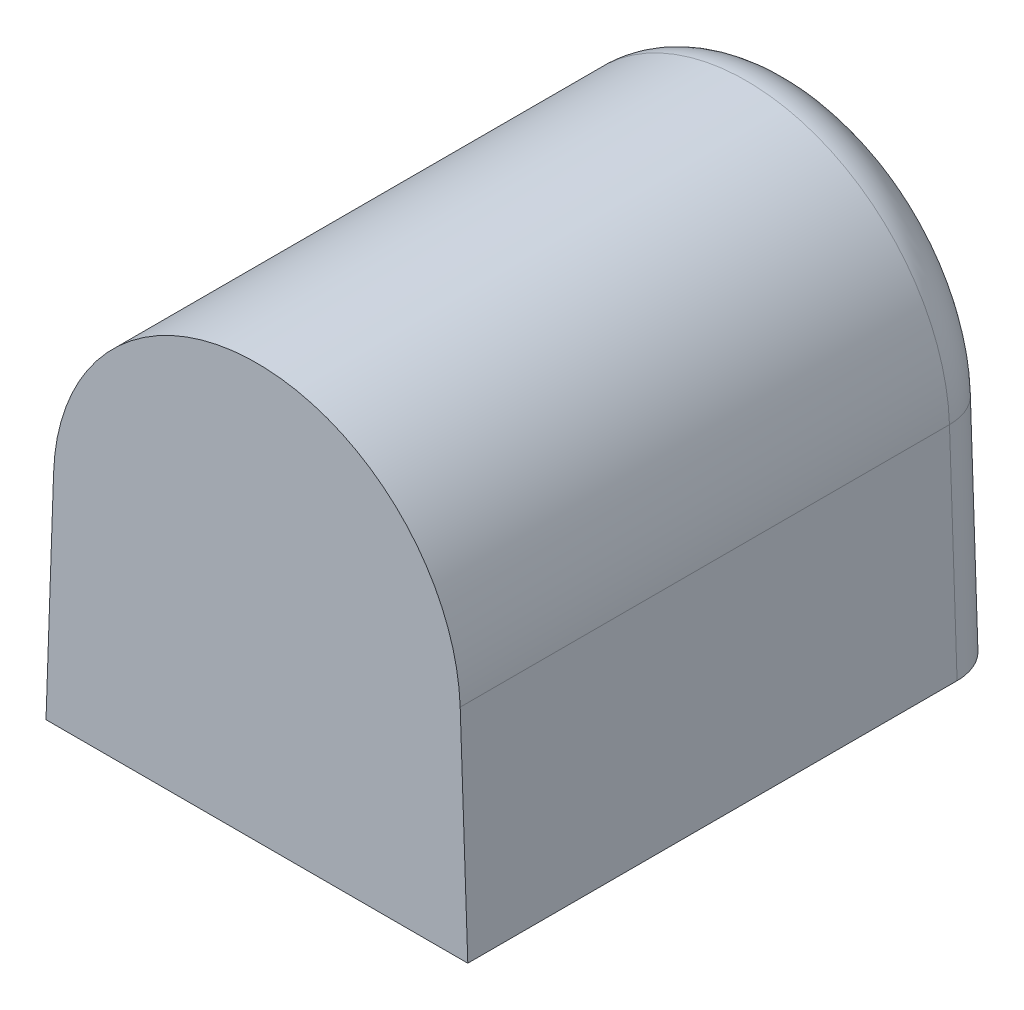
from build123d import *

# Parameters (mm, degrees)
BOSS_EXTRUDE1_DEPTH = 32
FILLET1_R           = 3


with BuildPart() as part:
    # Sketch1 → Boss-Extrude1 (new body)
    with BuildSketch(Plane.XY):
        with BuildLine():
            Line((-12.5, 0), (12.5, 0))
            Line((12.5, 0), (12.048797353, 12.920753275))
            ThreePointArc((12.048797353, 12.920753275), (0, 24.556141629), (-12.048797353, 12.920753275))
            Line((-12.048797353, 12.920753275), (-12.5, 0))
        make_face()
    extrude(amount=-BOSS_EXTRUDE1_DEPTH)

    # Fillet1
    fillet1_edges = [part.edges().sort_by_distance(p)[0] for p in [
        (-12.274398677, 6.460376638, -32),
        (12.274398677, 6.460376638, -32),
        (0, 24.556141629, -32),
    ]]
    fillet(fillet1_edges, radius=FILLET1_R)


solid = part.part
